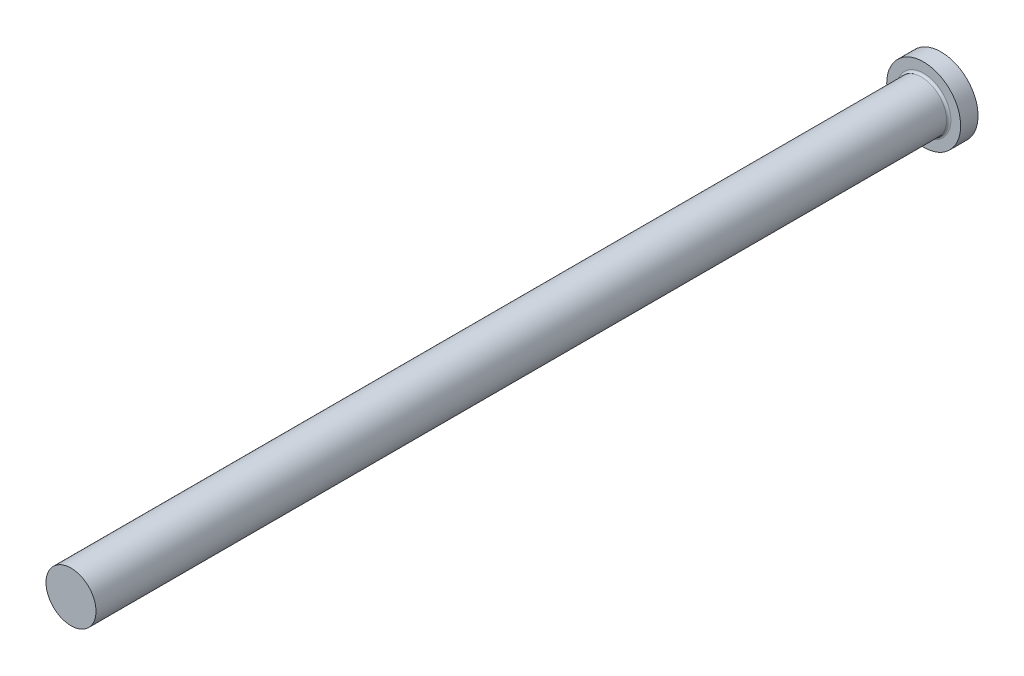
from build123d import *

# Parameters (mm, degrees)
FILLET1_R = 0.5


with BuildPart() as part:
    # FV → Revolve1 (revolve)
    with BuildSketch(Plane(origin=(0, 0, 0), x_dir=(1, 0, 0), z_dir=(0, 1, 0)), mode=Mode.PRIVATE) as revolve1_sk:
        Polygon((0, 0), (8.5, 0), (8.5, -4), (5.75, -4), (5.75, -200), (0, -200), align=None)
    revolve(revolve1_sk.sketch.rotate(Axis((0, 0, -9.033228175), (0, 0, 1)), 180), axis=Axis((0, 0, -9.033228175), (0, 0, 1)))

    # Fillet1
    fillet1_edges = [part.edges().sort_by_distance(p)[0] for p in [
        (5.75, 0, 4),
    ]]
    fillet(fillet1_edges, radius=FILLET1_R)


solid = part.part
